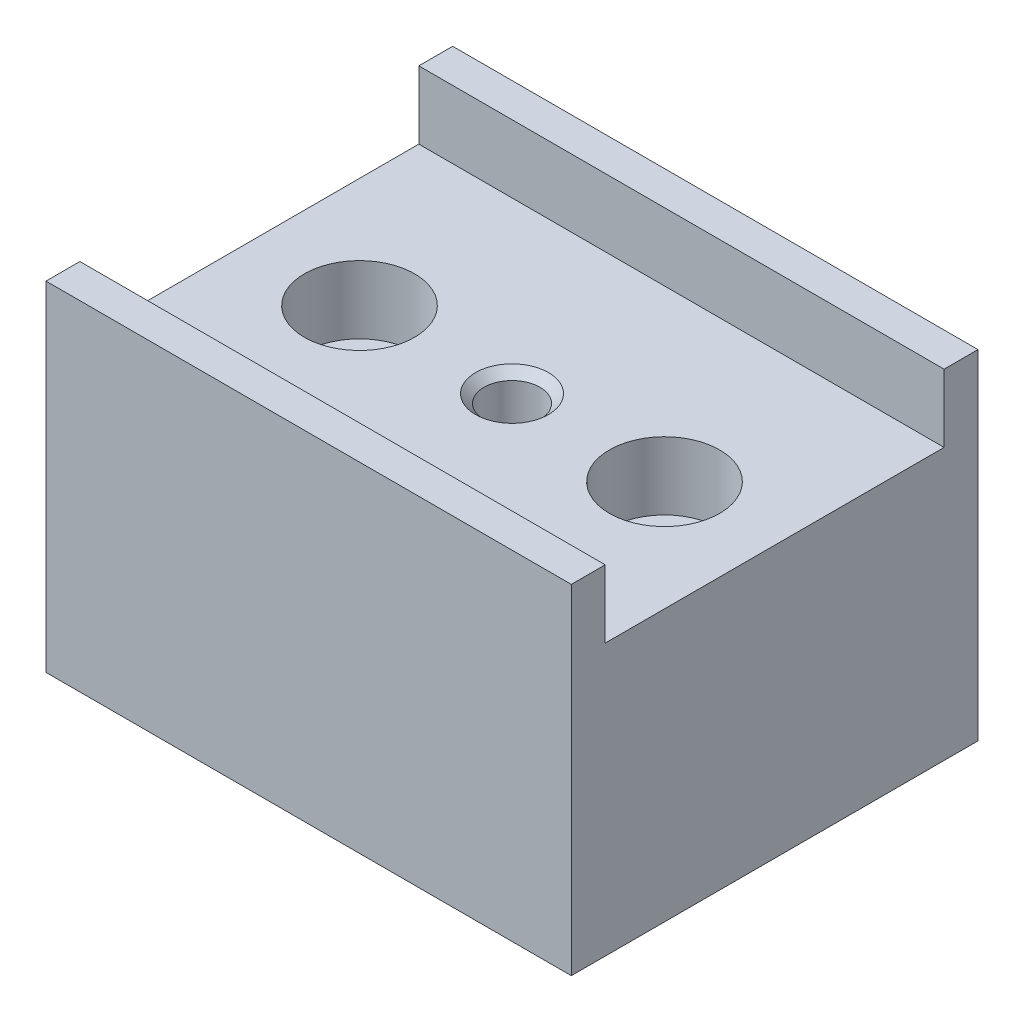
ISO-10303-21;
HEADER;
FILE_DESCRIPTION(('STEP AP214'),'2;1');
FILE_NAME('part.step','',(''),(''),'','','');
FILE_SCHEMA(('AUTOMOTIVE_DESIGN { 1 0 10303 214 1 1 1 1 }'));
ENDSEC;
DATA;
#1=APPLICATION_CONTEXT('core data for automotive mechanical design processes');
#2=APPLICATION_PROTOCOL_DEFINITION('international standard','automotive_design',2000,#1);
#3=PRODUCT_CONTEXT('',#1,'mechanical');
#4=PRODUCT('Part','Part','',(#3));
#5=PRODUCT_RELATED_PRODUCT_CATEGORY('part','',(#4));
#6=PRODUCT_DEFINITION_FORMATION('','',#4);
#7=PRODUCT_DEFINITION_CONTEXT('part definition',#1,'design');
#8=PRODUCT_DEFINITION('design','',#6,#7);
#9=PRODUCT_DEFINITION_SHAPE('','',#8);
#10=(LENGTH_UNIT() NAMED_UNIT(*) SI_UNIT(.MILLI.,.METRE.));
#11=(NAMED_UNIT(*) PLANE_ANGLE_UNIT() SI_UNIT($,.RADIAN.));
#12=(NAMED_UNIT(*) SI_UNIT($,.STERADIAN.) SOLID_ANGLE_UNIT());
#13=UNCERTAINTY_MEASURE_WITH_UNIT(LENGTH_MEASURE(1.E-05),#10,'distance_accuracy_value','');
#14=(GEOMETRIC_REPRESENTATION_CONTEXT(3) GLOBAL_UNCERTAINTY_ASSIGNED_CONTEXT((#13)) GLOBAL_UNIT_ASSIGNED_CONTEXT((#10,
#11,#12)) REPRESENTATION_CONTEXT('',''));
#15=CARTESIAN_POINT('',(0.,0.,0.));
#16=DIRECTION('',(0.,0.,1.));
#17=DIRECTION('',(1.,0.,0.));
#18=AXIS2_PLACEMENT_3D('',#15,#16,#17);
#19=CARTESIAN_POINT('',(-6.50000000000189,-1.16573417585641E-12,-3.77475828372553E-12));
#20=DIRECTION('',(0.,1.,0.));
#21=DIRECTION('',(0.,0.,1.));
#22=AXIS2_PLACEMENT_3D('',#19,#20,#21);
#23=CYLINDRICAL_SURFACE('',#22,1.7);
#24=CARTESIAN_POINT('',(-6.50000000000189,-1.16573417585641E-12,-3.77475828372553E-12));
#25=DIRECTION('',(0.,1.,0.));
#26=DIRECTION('',(0.,0.,1.));
#27=AXIS2_PLACEMENT_3D('',#24,#25,#26);
#28=CIRCLE('',#27,1.7);
#29=CARTESIAN_POINT('',(-6.50000000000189,-1.16582854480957E-12,1.69999999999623));
#30=VERTEX_POINT('',#29);
#31=EDGE_CURVE('E176',#30,#30,#28,.T.);
#32=CARTESIAN_POINT('',(-6.50000000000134,12.0000000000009,-3.99680288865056E-12));
#33=DIRECTION('',(0.,1.,0.));
#34=DIRECTION('',(0.,0.,1.));
#35=AXIS2_PLACEMENT_3D('',#32,#33,#34);
#36=CIRCLE('',#35,1.7);
#37=CARTESIAN_POINT('',(-6.50000000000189,12.0000000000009,1.69999999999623));
#38=VERTEX_POINT('',#37);
#39=EDGE_CURVE('E42',#38,#38,#36,.F.);
#40=CARTESIAN_POINT('',(-6.50000000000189,-1.16582854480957E-12,1.69999999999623));
#41=CARTESIAN_POINT('',(-6.50000000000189,0.124999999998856,1.69999999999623));
#42=CARTESIAN_POINT('',(-6.50000000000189,0.249999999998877,1.69999999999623));
#43=CARTESIAN_POINT('',(-6.50000000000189,0.49999999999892,1.69999999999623));
#44=CARTESIAN_POINT('',(-6.50000000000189,0.624999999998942,1.69999999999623));
#45=CARTESIAN_POINT('',(-6.50000000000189,0.874999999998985,1.69999999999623));
#46=CARTESIAN_POINT('',(-6.50000000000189,0.999999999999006,1.69999999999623));
#47=CARTESIAN_POINT('',(-6.50000000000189,1.24999999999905,1.69999999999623));
#48=CARTESIAN_POINT('',(-6.50000000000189,1.37499999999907,1.69999999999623));
#49=CARTESIAN_POINT('',(-6.50000000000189,1.62499999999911,1.69999999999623));
#50=CARTESIAN_POINT('',(-6.50000000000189,1.74999999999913,1.69999999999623));
#51=CARTESIAN_POINT('',(-6.50000000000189,1.99999999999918,1.69999999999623));
#52=CARTESIAN_POINT('',(-6.50000000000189,2.1249999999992,1.69999999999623));
#53=CARTESIAN_POINT('',(-6.50000000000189,2.37499999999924,1.69999999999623));
#54=CARTESIAN_POINT('',(-6.50000000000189,2.49999999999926,1.69999999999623));
#55=CARTESIAN_POINT('',(-6.50000000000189,2.74999999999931,1.69999999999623));
#56=CARTESIAN_POINT('',(-6.50000000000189,2.87499999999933,1.69999999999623));
#57=CARTESIAN_POINT('',(-6.50000000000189,3.12499999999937,1.69999999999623));
#58=CARTESIAN_POINT('',(-6.50000000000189,3.24999999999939,1.69999999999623));
#59=CARTESIAN_POINT('',(-6.50000000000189,3.49999999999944,1.69999999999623));
#60=CARTESIAN_POINT('',(-6.50000000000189,3.62499999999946,1.69999999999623));
#61=CARTESIAN_POINT('',(-6.50000000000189,3.8749999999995,1.69999999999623));
#62=CARTESIAN_POINT('',(-6.50000000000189,3.99999999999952,1.69999999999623));
#63=CARTESIAN_POINT('',(-6.50000000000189,4.24999999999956,1.69999999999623));
#64=CARTESIAN_POINT('',(-6.50000000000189,4.37499999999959,1.69999999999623));
#65=CARTESIAN_POINT('',(-6.50000000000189,4.62499999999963,1.69999999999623));
#66=CARTESIAN_POINT('',(-6.50000000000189,4.74999999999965,1.69999999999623));
#67=CARTESIAN_POINT('',(-6.50000000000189,4.99999999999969,1.69999999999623));
#68=CARTESIAN_POINT('',(-6.50000000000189,5.12499999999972,1.69999999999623));
#69=CARTESIAN_POINT('',(-6.50000000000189,5.37499999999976,1.69999999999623));
#70=CARTESIAN_POINT('',(-6.50000000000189,5.49999999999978,1.69999999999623));
#71=CARTESIAN_POINT('',(-6.50000000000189,5.74999999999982,1.69999999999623));
#72=CARTESIAN_POINT('',(-6.50000000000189,5.87499999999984,1.69999999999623));
#73=CARTESIAN_POINT('',(-6.50000000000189,6.12499999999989,1.69999999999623));
#74=CARTESIAN_POINT('',(-6.50000000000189,6.24999999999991,1.69999999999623));
#75=CARTESIAN_POINT('',(-6.50000000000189,6.49999999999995,1.69999999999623));
#76=CARTESIAN_POINT('',(-6.50000000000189,6.62499999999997,1.69999999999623));
#77=CARTESIAN_POINT('',(-6.50000000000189,6.87500000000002,1.69999999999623));
#78=CARTESIAN_POINT('',(-6.50000000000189,7.00000000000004,1.69999999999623));
#79=CARTESIAN_POINT('',(-6.50000000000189,7.25000000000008,1.69999999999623));
#80=CARTESIAN_POINT('',(-6.50000000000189,7.3750000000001,1.69999999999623));
#81=CARTESIAN_POINT('',(-6.50000000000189,7.62500000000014,1.69999999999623));
#82=CARTESIAN_POINT('',(-6.50000000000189,7.75000000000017,1.69999999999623));
#83=CARTESIAN_POINT('',(-6.50000000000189,8.00000000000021,1.69999999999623));
#84=CARTESIAN_POINT('',(-6.50000000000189,8.12500000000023,1.69999999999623));
#85=CARTESIAN_POINT('',(-6.50000000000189,8.37500000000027,1.69999999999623));
#86=CARTESIAN_POINT('',(-6.50000000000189,8.50000000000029,1.69999999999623));
#87=CARTESIAN_POINT('',(-6.50000000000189,8.75000000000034,1.69999999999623));
#88=CARTESIAN_POINT('',(-6.50000000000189,8.87500000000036,1.69999999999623));
#89=CARTESIAN_POINT('',(-6.50000000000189,9.1250000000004,1.69999999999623));
#90=CARTESIAN_POINT('',(-6.50000000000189,9.25000000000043,1.69999999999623));
#91=CARTESIAN_POINT('',(-6.50000000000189,9.50000000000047,1.69999999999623));
#92=CARTESIAN_POINT('',(-6.50000000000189,9.62500000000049,1.69999999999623));
#93=CARTESIAN_POINT('',(-6.50000000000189,9.87500000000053,1.69999999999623));
#94=CARTESIAN_POINT('',(-6.50000000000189,10.0000000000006,1.69999999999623));
#95=CARTESIAN_POINT('',(-6.50000000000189,10.2500000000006,1.69999999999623));
#96=CARTESIAN_POINT('',(-6.50000000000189,10.3750000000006,1.69999999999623));
#97=CARTESIAN_POINT('',(-6.50000000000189,10.6250000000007,1.69999999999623));
#98=CARTESIAN_POINT('',(-6.50000000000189,10.7500000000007,1.69999999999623));
#99=CARTESIAN_POINT('',(-6.50000000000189,11.0000000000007,1.69999999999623));
#100=CARTESIAN_POINT('',(-6.50000000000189,11.1250000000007,1.69999999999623));
#101=CARTESIAN_POINT('',(-6.50000000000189,11.3750000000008,1.69999999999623));
#102=CARTESIAN_POINT('',(-6.50000000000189,11.5000000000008,1.69999999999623));
#103=CARTESIAN_POINT('',(-6.50000000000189,11.7500000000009,1.69999999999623));
#104=CARTESIAN_POINT('',(-6.50000000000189,11.8750000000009,1.69999999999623));
#105=CARTESIAN_POINT('',(-6.50000000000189,12.0000000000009,1.69999999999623));
#106=B_SPLINE_CURVE_WITH_KNOTS('',3,(#40,#41,#42,#43,#44,#45,#46,#47,#48,#49,#50,#51,#52,#53,
#54,#55,#56,#57,#58,#59,#60,#61,#62,#63,#64,#65,#66,#67,#68,#69,#70,#71,#72,#73,#74,#75,#76,#77,
#78,#79,#80,#81,#82,#83,#84,#85,#86,#87,#88,#89,#90,#91,#92,#93,#94,#95,#96,#97,#98,#99,#100,
#101,#102,#103,#104,#105),.UNSPECIFIED.,.F.,.F.,(4,2,2,2,2,2,2,2,2,2,2,2,2,2,2,2,2,2,2,2,2,2,2,
2,2,2,2,2,2,2,2,2,4),(0.,0.375000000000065,0.750000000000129,1.12500000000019,1.50000000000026,
1.87500000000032,2.25000000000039,2.62500000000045,3.00000000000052,3.37500000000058,
3.75000000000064,4.12500000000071,4.50000000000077,4.87500000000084,5.2500000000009,
5.62500000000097,6.00000000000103,6.3750000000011,6.75000000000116,7.12500000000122,
7.50000000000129,7.87500000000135,8.25000000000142,8.62500000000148,9.00000000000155,
9.37500000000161,9.75000000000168,10.1250000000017,10.5000000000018,10.8750000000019,
11.2500000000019,11.625000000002,12.0000000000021),.UNSPECIFIED.);
#107=EDGE_CURVE('BSEAM38',#30,#38,#106,.T.);
#108=ORIENTED_EDGE('',*,*,#31,.F.);
#109=ORIENTED_EDGE('',*,*,#39,.F.);
#110=ORIENTED_EDGE('',*,*,#107,.T.);
#111=ORIENTED_EDGE('',*,*,#107,.F.);
#112=EDGE_LOOP('',(#108,#110,#109,#111));
#113=FACE_BOUND('',#112,.T.);
#114=ADVANCED_FACE('F38',(#113),#23,.F.);
#115=CARTESIAN_POINT('',(-24.5000000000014,2.22044604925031E-13,-2.88657986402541E-12));
#116=DIRECTION('',(0.,1.,0.));
#117=DIRECTION('',(0.,0.,1.));
#118=AXIS2_PLACEMENT_3D('',#115,#116,#117);
#119=CYLINDRICAL_SURFACE('',#118,1.7);
#120=CARTESIAN_POINT('',(-24.5000000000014,2.22044604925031E-13,-2.88657986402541E-12));
#121=DIRECTION('',(0.,1.,0.));
#122=DIRECTION('',(0.,0.,1.));
#123=AXIS2_PLACEMENT_3D('',#120,#121,#122);
#124=CIRCLE('',#123,1.7);
#125=CARTESIAN_POINT('',(-24.5000000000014,2.21950235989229E-13,1.69999999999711));
#126=VERTEX_POINT('',#125);
#127=EDGE_CURVE('E181',#126,#126,#124,.T.);
#128=CARTESIAN_POINT('',(-24.5000000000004,11.9999999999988,-3.99680288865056E-12));
#129=DIRECTION('',(0.,1.,0.));
#130=DIRECTION('',(0.,0.,1.));
#131=AXIS2_PLACEMENT_3D('',#128,#129,#130);
#132=CIRCLE('',#131,1.7);
#133=CARTESIAN_POINT('',(-24.5000000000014,11.9999999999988,1.69999999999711));
#134=VERTEX_POINT('',#133);
#135=EDGE_CURVE('E174',#134,#134,#132,.F.);
#136=CARTESIAN_POINT('',(-24.5000000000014,2.21950235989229E-13,1.69999999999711));
#137=CARTESIAN_POINT('',(-24.5000000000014,0.125000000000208,1.69999999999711));
#138=CARTESIAN_POINT('',(-24.5000000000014,0.250000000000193,1.69999999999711));
#139=CARTESIAN_POINT('',(-24.5000000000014,0.500000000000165,1.69999999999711));
#140=CARTESIAN_POINT('',(-24.5000000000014,0.62500000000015,1.69999999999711));
#141=CARTESIAN_POINT('',(-24.5000000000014,0.875000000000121,1.69999999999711));
#142=CARTESIAN_POINT('',(-24.5000000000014,1.00000000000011,1.69999999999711));
#143=CARTESIAN_POINT('',(-24.5000000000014,1.25000000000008,1.69999999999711));
#144=CARTESIAN_POINT('',(-24.5000000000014,1.37500000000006,1.69999999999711));
#145=CARTESIAN_POINT('',(-24.5000000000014,1.62500000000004,1.69999999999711));
#146=CARTESIAN_POINT('',(-24.5000000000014,1.75000000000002,1.69999999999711));
#147=CARTESIAN_POINT('',(-24.5000000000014,1.99999999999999,1.69999999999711));
#148=CARTESIAN_POINT('',(-24.5000000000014,2.12499999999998,1.69999999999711));
#149=CARTESIAN_POINT('',(-24.5000000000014,2.37499999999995,1.69999999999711));
#150=CARTESIAN_POINT('',(-24.5000000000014,2.49999999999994,1.69999999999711));
#151=CARTESIAN_POINT('',(-24.5000000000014,2.74999999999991,1.69999999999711));
#152=CARTESIAN_POINT('',(-24.5000000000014,2.87499999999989,1.69999999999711));
#153=CARTESIAN_POINT('',(-24.5000000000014,3.12499999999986,1.69999999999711));
#154=CARTESIAN_POINT('',(-24.5000000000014,3.24999999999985,1.69999999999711));
#155=CARTESIAN_POINT('',(-24.5000000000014,3.49999999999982,1.69999999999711));
#156=CARTESIAN_POINT('',(-24.5000000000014,3.62499999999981,1.69999999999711));
#157=CARTESIAN_POINT('',(-24.5000000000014,3.87499999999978,1.69999999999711));
#158=CARTESIAN_POINT('',(-24.5000000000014,3.99999999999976,1.69999999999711));
#159=CARTESIAN_POINT('',(-24.5000000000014,4.24999999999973,1.69999999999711));
#160=CARTESIAN_POINT('',(-24.5000000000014,4.37499999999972,1.69999999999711));
#161=CARTESIAN_POINT('',(-24.5000000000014,4.62499999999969,1.69999999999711));
#162=CARTESIAN_POINT('',(-24.5000000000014,4.74999999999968,1.69999999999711));
#163=CARTESIAN_POINT('',(-24.5000000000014,4.99999999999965,1.69999999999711));
#164=CARTESIAN_POINT('',(-24.5000000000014,5.12499999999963,1.69999999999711));
#165=CARTESIAN_POINT('',(-24.5000000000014,5.3749999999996,1.69999999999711));
#166=CARTESIAN_POINT('',(-24.5000000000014,5.49999999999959,1.69999999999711));
#167=CARTESIAN_POINT('',(-24.5000000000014,5.74999999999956,1.69999999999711));
#168=CARTESIAN_POINT('',(-24.5000000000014,5.87499999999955,1.69999999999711));
#169=CARTESIAN_POINT('',(-24.5000000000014,6.12499999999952,1.69999999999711));
#170=CARTESIAN_POINT('',(-24.5000000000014,6.2499999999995,1.69999999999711));
#171=CARTESIAN_POINT('',(-24.5000000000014,6.49999999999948,1.69999999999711));
#172=CARTESIAN_POINT('',(-24.5000000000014,6.62499999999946,1.69999999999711));
#173=CARTESIAN_POINT('',(-24.5000000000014,6.87499999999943,1.69999999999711));
#174=CARTESIAN_POINT('',(-24.5000000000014,6.99999999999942,1.69999999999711));
#175=CARTESIAN_POINT('',(-24.5000000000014,7.24999999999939,1.69999999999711));
#176=CARTESIAN_POINT('',(-24.5000000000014,7.37499999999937,1.69999999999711));
#177=CARTESIAN_POINT('',(-24.5000000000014,7.62499999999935,1.69999999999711));
#178=CARTESIAN_POINT('',(-24.5000000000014,7.74999999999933,1.69999999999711));
#179=CARTESIAN_POINT('',(-24.5000000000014,7.9999999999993,1.69999999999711));
#180=CARTESIAN_POINT('',(-24.5000000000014,8.12499999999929,1.69999999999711));
#181=CARTESIAN_POINT('',(-24.5000000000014,8.37499999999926,1.69999999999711));
#182=CARTESIAN_POINT('',(-24.5000000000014,8.49999999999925,1.69999999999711));
#183=CARTESIAN_POINT('',(-24.5000000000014,8.74999999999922,1.69999999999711));
#184=CARTESIAN_POINT('',(-24.5000000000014,8.8749999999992,1.69999999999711));
#185=CARTESIAN_POINT('',(-24.5000000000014,9.12499999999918,1.69999999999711));
#186=CARTESIAN_POINT('',(-24.5000000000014,9.24999999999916,1.69999999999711));
#187=CARTESIAN_POINT('',(-24.5000000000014,9.49999999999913,1.69999999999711));
#188=CARTESIAN_POINT('',(-24.5000000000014,9.62499999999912,1.69999999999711));
#189=CARTESIAN_POINT('',(-24.5000000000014,9.87499999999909,1.69999999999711));
#190=CARTESIAN_POINT('',(-24.5000000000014,9.99999999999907,1.69999999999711));
#191=CARTESIAN_POINT('',(-24.5000000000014,10.249999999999,1.69999999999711));
#192=CARTESIAN_POINT('',(-24.5000000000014,10.374999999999,1.69999999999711));
#193=CARTESIAN_POINT('',(-24.5000000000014,10.624999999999,1.69999999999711));
#194=CARTESIAN_POINT('',(-24.5000000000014,10.749999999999,1.69999999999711));
#195=CARTESIAN_POINT('',(-24.5000000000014,10.999999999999,1.69999999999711));
#196=CARTESIAN_POINT('',(-24.5000000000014,11.1249999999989,1.69999999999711));
#197=CARTESIAN_POINT('',(-24.5000000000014,11.3749999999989,1.69999999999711));
#198=CARTESIAN_POINT('',(-24.5000000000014,11.4999999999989,1.69999999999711));
#199=CARTESIAN_POINT('',(-24.5000000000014,11.7499999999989,1.69999999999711));
#200=CARTESIAN_POINT('',(-24.5000000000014,11.8749999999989,1.69999999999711));
#201=CARTESIAN_POINT('',(-24.5000000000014,11.9999999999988,1.69999999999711));
#202=B_SPLINE_CURVE_WITH_KNOTS('',3,(#136,#137,#138,#139,#140,#141,#142,#143,#144,#145,#146,
#147,#148,#149,#150,#151,#152,#153,#154,#155,#156,#157,#158,#159,#160,#161,#162,#163,#164,#165,
#166,#167,#168,#169,#170,#171,#172,#173,#174,#175,#176,#177,#178,#179,#180,#181,#182,#183,#184,
#185,#186,#187,#188,#189,#190,#191,#192,#193,#194,#195,#196,#197,#198,#199,#200,#201),
.UNSPECIFIED.,.F.,.F.,(4,2,2,2,2,2,2,2,2,2,2,2,2,2,2,2,2,2,2,2,2,2,2,2,2,2,2,2,2,2,2,2,4),(0.,
0.374999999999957,0.749999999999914,1.12499999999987,1.49999999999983,1.87499999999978,
2.24999999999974,2.6249999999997,2.99999999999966,3.37499999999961,3.74999999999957,
4.12499999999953,4.49999999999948,4.87499999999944,5.2499999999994,5.62499999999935,
5.99999999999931,6.37499999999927,6.74999999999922,7.12499999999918,7.49999999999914,
7.87499999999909,8.24999999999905,8.62499999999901,8.99999999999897,9.37499999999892,
9.74999999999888,10.1249999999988,10.4999999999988,10.8749999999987,11.2499999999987,
11.6249999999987,11.9999999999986),.UNSPECIFIED.);
#203=EDGE_CURVE('BSEAM225',#126,#134,#202,.T.);
#204=ORIENTED_EDGE('',*,*,#127,.F.);
#205=ORIENTED_EDGE('',*,*,#135,.F.);
#206=ORIENTED_EDGE('',*,*,#203,.T.);
#207=ORIENTED_EDGE('',*,*,#203,.F.);
#208=EDGE_LOOP('',(#204,#206,#205,#207));
#209=FACE_BOUND('',#208,.T.);
#210=ADVANCED_FACE('F225',(#209),#119,.F.);
#211=CARTESIAN_POINT('',(-31.0000000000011,20.0000000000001,-10.000000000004));
#212=DIRECTION('',(0.,0.,1.));
#213=DIRECTION('',(1.,0.,0.));
#214=AXIS2_PLACEMENT_3D('',#211,#212,#213);
#215=PLANE('',#214);
#216=DIRECTION('',(0.,-1.,0.));
#217=VECTOR('',#216,1.);
#218=CARTESIAN_POINT('',(-1.49880108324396E-12,19.9999999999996,-10.0000000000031));
#219=LINE('',#218,#217);
#220=CARTESIAN_POINT('',(-1.49880108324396E-12,19.9999999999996,-10.0000000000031));
#221=VERTEX_POINT('',#220);
#222=CARTESIAN_POINT('',(-2.1094237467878E-12,16.0000000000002,-10.0000000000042));
#223=VERTEX_POINT('',#222);
#224=EDGE_CURVE('E140',#221,#223,#219,.T.);
#225=ORIENTED_EDGE('',*,*,#224,.F.);
#226=DIRECTION('',(1.,0.,0.));
#227=VECTOR('',#226,1.);
#228=CARTESIAN_POINT('',(-31.0000000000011,20.0000000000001,-10.000000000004));
#229=LINE('',#228,#227);
#230=CARTESIAN_POINT('',(-31.0000000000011,20.0000000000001,-10.000000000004));
#231=VERTEX_POINT('',#230);
#232=EDGE_CURVE('E57',#231,#221,#229,.T.);
#233=ORIENTED_EDGE('',*,*,#232,.F.);
#234=DIRECTION('',(0.,-1.,0.));
#235=VECTOR('',#234,1.);
#236=CARTESIAN_POINT('',(-31.0000000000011,20.0000000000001,-10.000000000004));
#237=LINE('',#236,#235);
#238=CARTESIAN_POINT('',(-31.0000000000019,15.9999999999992,-10.0000000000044));
#239=VERTEX_POINT('',#238);
#240=EDGE_CURVE('E162',#231,#239,#237,.T.);
#241=ORIENTED_EDGE('',*,*,#240,.T.);
#242=DIRECTION('',(1.,0.,0.));
#243=VECTOR('',#242,1.);
#244=CARTESIAN_POINT('',(-31.0000000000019,15.9999999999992,-10.0000000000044));
#245=LINE('',#244,#243);
#246=EDGE_CURVE('E98',#239,#223,#245,.T.);
#247=ORIENTED_EDGE('',*,*,#246,.T.);
#248=EDGE_LOOP('',(#225,#233,#241,#247));
#249=FACE_BOUND('',#248,.T.);
#250=ADVANCED_FACE('F214',(#249),#215,.T.);
#251=CARTESIAN_POINT('',(-31.0000000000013,19.9999999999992,-12.000000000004));
#252=DIRECTION('',(0.,1.,0.));
#253=DIRECTION('',(0.,0.,1.));
#254=AXIS2_PLACEMENT_3D('',#251,#252,#253);
#255=PLANE('',#254);
#256=DIRECTION('',(0.,0.,1.));
#257=VECTOR('',#256,1.);
#258=CARTESIAN_POINT('',(-1.0547118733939E-12,19.9999999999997,-12.0000000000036));
#259=LINE('',#258,#257);
#260=CARTESIAN_POINT('',(-1.0547118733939E-12,19.9999999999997,-12.0000000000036));
#261=VERTEX_POINT('',#260);
#262=EDGE_CURVE('E159',#261,#221,#259,.T.);
#263=ORIENTED_EDGE('',*,*,#262,.F.);
#264=DIRECTION('',(1.,0.,0.));
#265=VECTOR('',#264,1.);
#266=CARTESIAN_POINT('',(-31.0000000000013,19.9999999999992,-12.000000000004));
#267=LINE('',#266,#265);
#268=CARTESIAN_POINT('',(-31.0000000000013,19.9999999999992,-12.000000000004));
#269=VERTEX_POINT('',#268);
#270=EDGE_CURVE('E86',#269,#261,#267,.T.);
#271=ORIENTED_EDGE('',*,*,#270,.F.);
#272=DIRECTION('',(0.,0.,1.));
#273=VECTOR('',#272,1.);
#274=CARTESIAN_POINT('',(-31.0000000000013,19.9999999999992,-12.000000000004));
#275=LINE('',#274,#273);
#276=EDGE_CURVE('E130',#269,#231,#275,.T.);
#277=ORIENTED_EDGE('',*,*,#276,.T.);
#278=ORIENTED_EDGE('',*,*,#232,.T.);
#279=EDGE_LOOP('',(#263,#271,#277,#278));
#280=FACE_BOUND('',#279,.T.);
#281=ADVANCED_FACE('F217',(#280),#255,.T.);
#282=CARTESIAN_POINT('',(-31.0000000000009,-7.7715611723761E-13,-12.0000000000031));
#283=DIRECTION('',(0.,0.,-1.));
#284=DIRECTION('',(-1.,0.,0.));
#285=AXIS2_PLACEMENT_3D('',#282,#283,#284);
#286=PLANE('',#285);
#287=DIRECTION('',(0.,1.,0.));
#288=VECTOR('',#287,1.);
#289=CARTESIAN_POINT('',(-7.7715611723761E-13,4.9960036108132E-13,-12.0000000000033));
#290=LINE('',#289,#288);
#291=CARTESIAN_POINT('',(-7.7715611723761E-13,4.9960036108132E-13,-12.0000000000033));
#292=VERTEX_POINT('',#291);
#293=EDGE_CURVE('E117',#292,#261,#290,.T.);
#294=ORIENTED_EDGE('',*,*,#293,.F.);
#295=DIRECTION('',(1.,0.,0.));
#296=VECTOR('',#295,1.);
#297=CARTESIAN_POINT('',(-31.0000000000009,-7.7715611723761E-13,-12.0000000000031));
#298=LINE('',#297,#296);
#299=CARTESIAN_POINT('',(-31.0000000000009,-7.7715611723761E-13,-12.0000000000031));
#300=VERTEX_POINT('',#299);
#301=EDGE_CURVE('E112',#300,#292,#298,.T.);
#302=ORIENTED_EDGE('',*,*,#301,.F.);
#303=DIRECTION('',(0.,1.,0.));
#304=VECTOR('',#303,1.);
#305=CARTESIAN_POINT('',(-31.0000000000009,-7.7715611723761E-13,-12.0000000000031));
#306=LINE('',#305,#304);
#307=EDGE_CURVE('E115',#300,#269,#306,.T.);
#308=ORIENTED_EDGE('',*,*,#307,.T.);
#309=ORIENTED_EDGE('',*,*,#270,.T.);
#310=EDGE_LOOP('',(#294,#302,#308,#309));
#311=FACE_BOUND('',#310,.T.);
#312=ADVANCED_FACE('F114',(#311),#286,.T.);
#313=CARTESIAN_POINT('',(-31.0000000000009,-7.7715611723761E-13,-12.0000000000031));
#314=DIRECTION('',(0.,-1.,0.));
#315=DIRECTION('',(0.,0.,-1.));
#316=AXIS2_PLACEMENT_3D('',#313,#314,#315);
#317=PLANE('',#316);
#318=ORIENTED_EDGE('',*,*,#31,.T.);
#319=EDGE_LOOP('',(#318));
#320=FACE_BOUND('',#319,.T.);
#321=ORIENTED_EDGE('',*,*,#127,.T.);
#322=EDGE_LOOP('',(#321));
#323=FACE_BOUND('',#322,.T.);
#324=CARTESIAN_POINT('',(-15.5,-9.99200722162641E-13,-3.77475828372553E-12));
#325=DIRECTION('',(0.,1.,0.));
#326=DIRECTION('',(0.,0.,1.));
#327=AXIS2_PLACEMENT_3D('',#324,#325,#326);
#328=CIRCLE('',#327,1.65);
#329=CARTESIAN_POINT('',(-15.5000000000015,-9.99200722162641E-13,1.64999999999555));
#330=VERTEX_POINT('',#329);
#331=EDGE_CURVE('E144',#330,#330,#328,.T.);
#332=ORIENTED_EDGE('',*,*,#331,.T.);
#333=EDGE_LOOP('',(#332));
#334=FACE_BOUND('',#333,.T.);
#335=DIRECTION('',(0.,0.,-1.));
#336=VECTOR('',#335,1.);
#337=CARTESIAN_POINT('',(-7.7715611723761E-13,4.9960036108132E-13,-12.0000000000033));
#338=LINE('',#337,#336);
#339=CARTESIAN_POINT('',(-1.66533453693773E-12,-7.21644966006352E-13,11.9999999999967));
#340=VERTEX_POINT('',#339);
#341=EDGE_CURVE('E156',#340,#292,#338,.T.);
#342=ORIENTED_EDGE('',*,*,#341,.F.);
#343=DIRECTION('',(1.,0.,0.));
#344=VECTOR('',#343,1.);
#345=CARTESIAN_POINT('',(-31.0000000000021,8.88178419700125E-13,11.9999999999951));
#346=LINE('',#345,#344);
#347=CARTESIAN_POINT('',(-31.0000000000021,8.88178419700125E-13,11.9999999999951));
#348=VERTEX_POINT('',#347);
#349=EDGE_CURVE('E122',#348,#340,#346,.T.);
#350=ORIENTED_EDGE('',*,*,#349,.F.);
#351=DIRECTION('',(0.,0.,-1.));
#352=VECTOR('',#351,1.);
#353=CARTESIAN_POINT('',(-31.0000000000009,-7.7715611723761E-13,-12.0000000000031));
#354=LINE('',#353,#352);
#355=EDGE_CURVE('E128',#348,#300,#354,.T.);
#356=ORIENTED_EDGE('',*,*,#355,.T.);
#357=ORIENTED_EDGE('',*,*,#301,.T.);
#358=EDGE_LOOP('',(#342,#350,#356,#357));
#359=FACE_BOUND('',#358,.T.);
#360=ADVANCED_FACE('F132',(#320,#323,#334,#359),#317,.T.);
#361=CARTESIAN_POINT('',(-31.0000000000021,8.88178419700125E-13,11.9999999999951));
#362=DIRECTION('',(0.,0.,1.));
#363=DIRECTION('',(1.,0.,0.));
#364=AXIS2_PLACEMENT_3D('',#361,#362,#363);
#365=PLANE('',#364);
#366=DIRECTION('',(0.,-1.,0.));
#367=VECTOR('',#366,1.);
#368=CARTESIAN_POINT('',(-1.66533453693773E-12,-7.21644966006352E-13,11.9999999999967));
#369=LINE('',#368,#367);
#370=CARTESIAN_POINT('',(-7.7715611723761E-13,19.9999999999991,11.9999999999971));
#371=VERTEX_POINT('',#370);
#372=EDGE_CURVE('E153',#371,#340,#369,.T.);
#373=ORIENTED_EDGE('',*,*,#372,.F.);
#374=DIRECTION('',(1.,0.,0.));
#375=VECTOR('',#374,1.);
#376=CARTESIAN_POINT('',(-31.0000000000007,20.0000000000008,11.9999999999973));
#377=LINE('',#376,#375);
#378=CARTESIAN_POINT('',(-31.0000000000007,20.0000000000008,11.9999999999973));
#379=VERTEX_POINT('',#378);
#380=EDGE_CURVE('E166',#379,#371,#377,.T.);
#381=ORIENTED_EDGE('',*,*,#380,.F.);
#382=DIRECTION('',(0.,-1.,0.));
#383=VECTOR('',#382,1.);
#384=CARTESIAN_POINT('',(-31.0000000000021,8.88178419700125E-13,11.9999999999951));
#385=LINE('',#384,#383);
#386=EDGE_CURVE('E133',#379,#348,#385,.T.);
#387=ORIENTED_EDGE('',*,*,#386,.T.);
#388=ORIENTED_EDGE('',*,*,#349,.T.);
#389=EDGE_LOOP('',(#373,#381,#387,#388));
#390=FACE_BOUND('',#389,.T.);
#391=ADVANCED_FACE('F314',(#390),#365,.T.);
#392=CARTESIAN_POINT('',(-31.0000000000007,20.0000000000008,11.9999999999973));
#393=DIRECTION('',(0.,1.,0.));
#394=DIRECTION('',(0.,0.,1.));
#395=AXIS2_PLACEMENT_3D('',#392,#393,#394);
#396=PLANE('',#395);
#397=DIRECTION('',(0.,0.,1.));
#398=VECTOR('',#397,1.);
#399=CARTESIAN_POINT('',(-7.7715611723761E-13,19.9999999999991,11.9999999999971));
#400=LINE('',#399,#398);
#401=CARTESIAN_POINT('',(-1.16573417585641E-12,20.0000000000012,9.99999999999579));
#402=VERTEX_POINT('',#401);
#403=EDGE_CURVE('E150',#402,#371,#400,.T.);
#404=ORIENTED_EDGE('',*,*,#403,.F.);
#405=DIRECTION('',(1.,0.,0.));
#406=VECTOR('',#405,1.);
#407=CARTESIAN_POINT('',(-31.0000000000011,19.9999999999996,9.99999999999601));
#408=LINE('',#407,#406);
#409=CARTESIAN_POINT('',(-31.0000000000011,19.9999999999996,9.99999999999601));
#410=VERTEX_POINT('',#409);
#411=EDGE_CURVE('E168',#410,#402,#408,.T.);
#412=ORIENTED_EDGE('',*,*,#411,.F.);
#413=DIRECTION('',(0.,0.,1.));
#414=VECTOR('',#413,1.);
#415=CARTESIAN_POINT('',(-31.0000000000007,20.0000000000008,11.9999999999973));
#416=LINE('',#415,#414);
#417=EDGE_CURVE('E135',#410,#379,#416,.T.);
#418=ORIENTED_EDGE('',*,*,#417,.T.);
#419=ORIENTED_EDGE('',*,*,#380,.T.);
#420=EDGE_LOOP('',(#404,#412,#418,#419));
#421=FACE_BOUND('',#420,.T.);
#422=ADVANCED_FACE('F207',(#421),#396,.T.);
#423=CARTESIAN_POINT('',(-31.0000000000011,19.9999999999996,9.99999999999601));
#424=DIRECTION('',(0.,0.,-1.));
#425=DIRECTION('',(-1.,0.,0.));
#426=AXIS2_PLACEMENT_3D('',#423,#424,#425);
#427=PLANE('',#426);
#428=DIRECTION('',(0.,1.,0.));
#429=VECTOR('',#428,1.);
#430=CARTESIAN_POINT('',(-1.16573417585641E-12,20.0000000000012,9.99999999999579));
#431=LINE('',#430,#429);
#432=CARTESIAN_POINT('',(-1.33226762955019E-12,16.0000000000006,9.99999999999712));
#433=VERTEX_POINT('',#432);
#434=EDGE_CURVE('E147',#433,#402,#431,.T.);
#435=ORIENTED_EDGE('',*,*,#434,.F.);
#436=DIRECTION('',(1.,0.,0.));
#437=VECTOR('',#436,1.);
#438=CARTESIAN_POINT('',(-31.0000000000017,15.9999999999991,9.99999999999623));
#439=LINE('',#438,#437);
#440=CARTESIAN_POINT('',(-31.0000000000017,15.9999999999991,9.99999999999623));
#441=VERTEX_POINT('',#440);
#442=EDGE_CURVE('E170',#441,#433,#439,.T.);
#443=ORIENTED_EDGE('',*,*,#442,.F.);
#444=DIRECTION('',(0.,1.,0.));
#445=VECTOR('',#444,1.);
#446=CARTESIAN_POINT('',(-31.0000000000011,19.9999999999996,9.99999999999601));
#447=LINE('',#446,#445);
#448=EDGE_CURVE('E201',#441,#410,#447,.T.);
#449=ORIENTED_EDGE('',*,*,#448,.T.);
#450=ORIENTED_EDGE('',*,*,#411,.T.);
#451=EDGE_LOOP('',(#435,#443,#449,#450));
#452=FACE_BOUND('',#451,.T.);
#453=ADVANCED_FACE('F212',(#452),#427,.T.);
#454=CARTESIAN_POINT('',(-31.0000000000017,15.9999999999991,9.99999999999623));
#455=DIRECTION('',(0.,1.,0.));
#456=DIRECTION('',(0.,0.,1.));
#457=AXIS2_PLACEMENT_3D('',#454,#455,#456);
#458=PLANE('',#457);
#459=CARTESIAN_POINT('',(-6.50000000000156,16.0000000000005,-3.77475828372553E-12));
#460=DIRECTION('',(0.,1.,0.));
#461=DIRECTION('',(0.,0.,1.));
#462=AXIS2_PLACEMENT_3D('',#459,#460,#461);
#463=CIRCLE('',#462,3.25);
#464=CARTESIAN_POINT('',(-6.50000000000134,16.0000000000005,3.249999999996));
#465=VERTEX_POINT('',#464);
#466=EDGE_CURVE('E191',#465,#465,#463,.T.);
#467=ORIENTED_EDGE('',*,*,#466,.F.);
#468=EDGE_LOOP('',(#467));
#469=FACE_BOUND('',#468,.T.);
#470=CARTESIAN_POINT('',(-24.5000000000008,15.9999999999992,-2.66453525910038E-12));
#471=DIRECTION('',(0.,1.,0.));
#472=DIRECTION('',(0.,0.,1.));
#473=AXIS2_PLACEMENT_3D('',#470,#471,#472);
#474=CIRCLE('',#473,3.25);
#475=CARTESIAN_POINT('',(-24.5000000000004,15.9999999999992,3.249999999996));
#476=VERTEX_POINT('',#475);
#477=EDGE_CURVE('E184',#476,#476,#474,.T.);
#478=ORIENTED_EDGE('',*,*,#477,.F.);
#479=EDGE_LOOP('',(#478));
#480=FACE_BOUND('',#479,.T.);
#481=CARTESIAN_POINT('',(-15.5000000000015,15.9999999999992,-4.44089209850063E-12));
#482=DIRECTION('',(0.,1.,0.));
#483=DIRECTION('',(0.,0.,1.));
#484=AXIS2_PLACEMENT_3D('',#481,#482,#483);
#485=CIRCLE('',#484,2.14999999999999);
#486=CARTESIAN_POINT('',(-15.5000000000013,15.9999999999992,2.14999999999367));
#487=VERTEX_POINT('',#486);
#488=EDGE_CURVE('E11',#487,#487,#485,.F.);
#489=ORIENTED_EDGE('',*,*,#488,.T.);
#490=EDGE_LOOP('',(#489));
#491=FACE_BOUND('',#490,.T.);
#492=DIRECTION('',(0.,0.,1.));
#493=VECTOR('',#492,1.);
#494=CARTESIAN_POINT('',(-1.33226762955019E-12,16.0000000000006,9.99999999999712));
#495=LINE('',#494,#493);
#496=EDGE_CURVE('E143',#223,#433,#495,.T.);
#497=ORIENTED_EDGE('',*,*,#496,.F.);
#498=ORIENTED_EDGE('',*,*,#246,.F.);
#499=DIRECTION('',(0.,0.,1.));
#500=VECTOR('',#499,1.);
#501=CARTESIAN_POINT('',(-31.0000000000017,15.9999999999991,9.99999999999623));
#502=LINE('',#501,#500);
#503=EDGE_CURVE('E199',#239,#441,#502,.T.);
#504=ORIENTED_EDGE('',*,*,#503,.T.);
#505=ORIENTED_EDGE('',*,*,#442,.T.);
#506=EDGE_LOOP('',(#497,#498,#504,#505));
#507=FACE_BOUND('',#506,.T.);
#508=ADVANCED_FACE('F213',(#469,#480,#491,#507),#458,.T.);
#509=CARTESIAN_POINT('',(-31.0000000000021,-1.4432899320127E-12,-2.44249065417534E-12));
#510=DIRECTION('',(1.,0.,0.));
#511=DIRECTION('',(0.,0.,-1.));
#512=AXIS2_PLACEMENT_3D('',#509,#510,#511);
#513=PLANE('',#512);
#514=ORIENTED_EDGE('',*,*,#240,.F.);
#515=ORIENTED_EDGE('',*,*,#276,.F.);
#516=ORIENTED_EDGE('',*,*,#307,.F.);
#517=ORIENTED_EDGE('',*,*,#355,.F.);
#518=ORIENTED_EDGE('',*,*,#386,.F.);
#519=ORIENTED_EDGE('',*,*,#417,.F.);
#520=ORIENTED_EDGE('',*,*,#448,.F.);
#521=ORIENTED_EDGE('',*,*,#503,.F.);
#522=EDGE_LOOP('',(#514,#515,#516,#517,#518,#519,#520,#521));
#523=FACE_BOUND('',#522,.T.);
#524=ADVANCED_FACE('F126',(#523),#513,.F.);
#525=CARTESIAN_POINT('',(0.,0.,0.));
#526=DIRECTION('',(1.,0.,0.));
#527=DIRECTION('',(0.,0.,-1.));
#528=AXIS2_PLACEMENT_3D('',#525,#526,#527);
#529=PLANE('',#528);
#530=ORIENTED_EDGE('',*,*,#224,.T.);
#531=ORIENTED_EDGE('',*,*,#496,.T.);
#532=ORIENTED_EDGE('',*,*,#434,.T.);
#533=ORIENTED_EDGE('',*,*,#403,.T.);
#534=ORIENTED_EDGE('',*,*,#372,.T.);
#535=ORIENTED_EDGE('',*,*,#341,.T.);
#536=ORIENTED_EDGE('',*,*,#293,.T.);
#537=ORIENTED_EDGE('',*,*,#262,.T.);
#538=EDGE_LOOP('',(#530,#531,#532,#533,#534,#535,#536,#537));
#539=FACE_BOUND('',#538,.T.);
#540=ADVANCED_FACE('F216',(#539),#529,.T.);
#541=CARTESIAN_POINT('',(-15.5000000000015,15.9999999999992,-4.44089209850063E-12));
#542=DIRECTION('',(0.,1.,0.));
#543=DIRECTION('',(0.,0.,1.));
#544=AXIS2_PLACEMENT_3D('',#541,#542,#543);
#545=CYLINDRICAL_SURFACE('',#544,1.64999999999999);
#546=CARTESIAN_POINT('',(-15.5000000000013,15.5,-5.55111512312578E-12));
#547=DIRECTION('',(0.,1.,0.));
#548=DIRECTION('',(0.,0.,1.));
#549=AXIS2_PLACEMENT_3D('',#546,#547,#548);
#550=CIRCLE('',#549,1.64999999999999);
#551=CARTESIAN_POINT('',(-15.5000000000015,15.5,1.64999999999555));
#552=VERTEX_POINT('',#551);
#553=EDGE_CURVE('E48',#552,#552,#550,.T.);
#554=CARTESIAN_POINT('',(-15.5000000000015,15.5,1.64999999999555));
#555=CARTESIAN_POINT('',(-15.5000000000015,15.3385416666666,1.64999999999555));
#556=CARTESIAN_POINT('',(-15.5000000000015,15.1770833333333,1.64999999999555));
#557=CARTESIAN_POINT('',(-15.5000000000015,14.8541666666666,1.64999999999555));
#558=CARTESIAN_POINT('',(-15.5000000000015,14.6927083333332,1.64999999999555));
#559=CARTESIAN_POINT('',(-15.5000000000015,14.3697916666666,1.64999999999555));
#560=CARTESIAN_POINT('',(-15.5000000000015,14.2083333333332,1.64999999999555));
#561=CARTESIAN_POINT('',(-15.5000000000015,13.8854166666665,1.64999999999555));
#562=CARTESIAN_POINT('',(-15.5000000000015,13.7239583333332,1.64999999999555));
#563=CARTESIAN_POINT('',(-15.5000000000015,13.4010416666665,1.64999999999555));
#564=CARTESIAN_POINT('',(-15.5000000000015,13.2395833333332,1.64999999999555));
#565=CARTESIAN_POINT('',(-15.5000000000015,12.9166666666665,1.64999999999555));
#566=CARTESIAN_POINT('',(-15.5000000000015,12.7552083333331,1.64999999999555));
#567=CARTESIAN_POINT('',(-15.5000000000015,12.4322916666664,1.64999999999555));
#568=CARTESIAN_POINT('',(-15.5000000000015,12.2708333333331,1.64999999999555));
#569=CARTESIAN_POINT('',(-15.5000000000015,11.9479166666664,1.64999999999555));
#570=CARTESIAN_POINT('',(-15.5000000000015,11.7864583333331,1.64999999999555));
#571=CARTESIAN_POINT('',(-15.5000000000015,11.4635416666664,1.64999999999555));
#572=CARTESIAN_POINT('',(-15.5000000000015,11.302083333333,1.64999999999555));
#573=CARTESIAN_POINT('',(-15.5000000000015,10.9791666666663,1.64999999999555));
#574=CARTESIAN_POINT('',(-15.5000000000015,10.817708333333,1.64999999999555));
#575=CARTESIAN_POINT('',(-15.5000000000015,10.4947916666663,1.64999999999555));
#576=CARTESIAN_POINT('',(-15.5000000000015,10.333333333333,1.64999999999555));
#577=CARTESIAN_POINT('',(-15.5000000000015,10.0104166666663,1.64999999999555));
#578=CARTESIAN_POINT('',(-15.5000000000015,9.84895833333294,1.64999999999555));
#579=CARTESIAN_POINT('',(-15.5000000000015,9.52604166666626,1.64999999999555));
#580=CARTESIAN_POINT('',(-15.5000000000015,9.36458333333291,1.64999999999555));
#581=CARTESIAN_POINT('',(-15.5000000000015,9.04166666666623,1.64999999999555));
#582=CARTESIAN_POINT('',(-15.5000000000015,8.88020833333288,1.64999999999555));
#583=CARTESIAN_POINT('',(-15.5000000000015,8.5572916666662,1.64999999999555));
#584=CARTESIAN_POINT('',(-15.5000000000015,8.39583333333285,1.64999999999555));
#585=CARTESIAN_POINT('',(-15.5000000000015,8.07291666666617,1.64999999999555));
#586=CARTESIAN_POINT('',(-15.5000000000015,7.91145833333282,1.64999999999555));
#587=CARTESIAN_POINT('',(-15.5000000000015,7.58854166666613,1.64999999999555));
#588=CARTESIAN_POINT('',(-15.5000000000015,7.42708333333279,1.64999999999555));
#589=CARTESIAN_POINT('',(-15.5000000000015,7.1041666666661,1.64999999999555));
#590=CARTESIAN_POINT('',(-15.5000000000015,6.94270833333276,1.64999999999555));
#591=CARTESIAN_POINT('',(-15.5000000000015,6.61979166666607,1.64999999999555));
#592=CARTESIAN_POINT('',(-15.5000000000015,6.45833333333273,1.64999999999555));
#593=CARTESIAN_POINT('',(-15.5000000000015,6.13541666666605,1.64999999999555));
#594=CARTESIAN_POINT('',(-15.5000000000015,5.9739583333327,1.64999999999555));
#595=CARTESIAN_POINT('',(-15.5000000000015,5.65104166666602,1.64999999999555));
#596=CARTESIAN_POINT('',(-15.5000000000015,5.48958333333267,1.64999999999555));
#597=CARTESIAN_POINT('',(-15.5000000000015,5.16666666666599,1.64999999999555));
#598=CARTESIAN_POINT('',(-15.5000000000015,5.00520833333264,1.64999999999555));
#599=CARTESIAN_POINT('',(-15.5000000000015,4.68229166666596,1.64999999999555));
#600=CARTESIAN_POINT('',(-15.5000000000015,4.52083333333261,1.64999999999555));
#601=CARTESIAN_POINT('',(-15.5000000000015,4.19791666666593,1.64999999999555));
#602=CARTESIAN_POINT('',(-15.5000000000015,4.03645833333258,1.64999999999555));
#603=CARTESIAN_POINT('',(-15.5000000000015,3.7135416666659,1.64999999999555));
#604=CARTESIAN_POINT('',(-15.5000000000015,3.55208333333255,1.64999999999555));
#605=CARTESIAN_POINT('',(-15.5000000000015,3.22916666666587,1.64999999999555));
#606=CARTESIAN_POINT('',(-15.5000000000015,3.06770833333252,1.64999999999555));
#607=CARTESIAN_POINT('',(-15.5000000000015,2.74479166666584,1.64999999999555));
#608=CARTESIAN_POINT('',(-15.5000000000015,2.58333333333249,1.64999999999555));
#609=CARTESIAN_POINT('',(-15.5000000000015,2.26041666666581,1.64999999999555));
#610=CARTESIAN_POINT('',(-15.5000000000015,2.09895833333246,1.64999999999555));
#611=CARTESIAN_POINT('',(-15.5000000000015,1.77604166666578,1.64999999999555));
#612=CARTESIAN_POINT('',(-15.5000000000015,1.61458333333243,1.64999999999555));
#613=CARTESIAN_POINT('',(-15.5000000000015,1.29166666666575,1.64999999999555));
#614=CARTESIAN_POINT('',(-15.5000000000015,1.1302083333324,1.64999999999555));
#615=CARTESIAN_POINT('',(-15.5000000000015,0.807291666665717,1.64999999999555));
#616=CARTESIAN_POINT('',(-15.5000000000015,0.645833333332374,1.64999999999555));
#617=CARTESIAN_POINT('',(-15.5000000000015,0.322916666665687,1.64999999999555));
#618=CARTESIAN_POINT('',(-15.5000000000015,0.161458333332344,1.64999999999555));
#619=CARTESIAN_POINT('',(-15.5000000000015,-9.99200722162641E-13,1.64999999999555));
#620=B_SPLINE_CURVE_WITH_KNOTS('',3,(#554,#555,#556,#557,#558,#559,#560,#561,#562,#563,#564,
#565,#566,#567,#568,#569,#570,#571,#572,#573,#574,#575,#576,#577,#578,#579,#580,#581,#582,#583,
#584,#585,#586,#587,#588,#589,#590,#591,#592,#593,#594,#595,#596,#597,#598,#599,#600,#601,#602,
#603,#604,#605,#606,#607,#608,#609,#610,#611,#612,#613,#614,#615,#616,#617,#618,#619),
.UNSPECIFIED.,.F.,.F.,(4,2,2,2,2,2,2,2,2,2,2,2,2,2,2,2,2,2,2,2,2,2,2,2,2,2,2,2,2,2,2,2,4),(0.,
0.48437500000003,0.96875000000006,1.45312500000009,1.93750000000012,2.42187500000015,
2.90625000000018,3.39062500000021,3.87500000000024,4.35937500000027,4.8437500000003,
5.32812500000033,5.81250000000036,6.29687500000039,6.78125000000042,7.26562500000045,
7.75000000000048,8.23437500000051,8.71875000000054,9.20312500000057,9.6875000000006,
10.1718750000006,10.6562500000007,11.1406250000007,11.6250000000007,12.1093750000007,
12.5937500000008,13.0781250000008,13.5625000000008,14.0468750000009,14.5312500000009,
15.0156250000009,15.500000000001),.UNSPECIFIED.);
#621=EDGE_CURVE('BSEAM241',#552,#330,#620,.T.);
#622=ORIENTED_EDGE('',*,*,#553,.T.);
#623=ORIENTED_EDGE('',*,*,#331,.F.);
#624=ORIENTED_EDGE('',*,*,#621,.T.);
#625=ORIENTED_EDGE('',*,*,#621,.F.);
#626=EDGE_LOOP('',(#622,#624,#623,#625));
#627=FACE_BOUND('',#626,.T.);
#628=ADVANCED_FACE('F241',(#627),#545,.F.);
#629=CARTESIAN_POINT('',(-15.5000000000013,15.5,-5.55111512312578E-12));
#630=DIRECTION('',(0.,1.,0.));
#631=DIRECTION('',(0.,0.,1.));
#632=AXIS2_PLACEMENT_3D('',#629,#630,#631);
#633=CONICAL_SURFACE('',#632,1.64999999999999,0.785398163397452);
#634=CARTESIAN_POINT('',(-15.5000000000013,15.9999999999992,2.14999999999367));
#635=CARTESIAN_POINT('',(-15.5000000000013,15.9947916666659,2.14479166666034));
#636=CARTESIAN_POINT('',(-15.5000000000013,15.9895833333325,2.13958333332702));
#637=CARTESIAN_POINT('',(-15.5000000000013,15.9791666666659,2.12916666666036));
#638=CARTESIAN_POINT('',(-15.5000000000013,15.9739583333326,2.12395833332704));
#639=CARTESIAN_POINT('',(-15.5000000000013,15.9635416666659,2.11354166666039));
#640=CARTESIAN_POINT('',(-15.5000000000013,15.9583333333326,2.10833333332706));
#641=CARTESIAN_POINT('',(-15.5000000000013,15.9479166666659,2.09791666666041));
#642=CARTESIAN_POINT('',(-15.5000000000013,15.9427083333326,2.09270833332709));
#643=CARTESIAN_POINT('',(-15.5000000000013,15.932291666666,2.08229166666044));
#644=CARTESIAN_POINT('',(-15.5000000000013,15.9270833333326,2.07708333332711));
#645=CARTESIAN_POINT('',(-15.5000000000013,15.916666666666,2.06666666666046));
#646=CARTESIAN_POINT('',(-15.5000000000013,15.9114583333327,2.06145833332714));
#647=CARTESIAN_POINT('',(-15.5000000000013,15.901041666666,2.05104166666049));
#648=CARTESIAN_POINT('',(-15.5000000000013,15.8958333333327,2.04583333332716));
#649=CARTESIAN_POINT('',(-15.5000000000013,15.885416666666,2.03541666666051));
#650=CARTESIAN_POINT('',(-15.5000000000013,15.8802083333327,2.03020833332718));
#651=CARTESIAN_POINT('',(-15.5000000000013,15.869791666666,2.01979166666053));
#652=CARTESIAN_POINT('',(-15.5000000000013,15.8645833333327,2.01458333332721));
#653=CARTESIAN_POINT('',(-15.5000000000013,15.8541666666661,2.00416666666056));
#654=CARTESIAN_POINT('',(-15.5000000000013,15.8489583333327,1.99895833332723));
#655=CARTESIAN_POINT('',(-15.5000000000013,15.8385416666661,1.98854166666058));
#656=CARTESIAN_POINT('',(-15.5000000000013,15.8333333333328,1.98333333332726));
#657=CARTESIAN_POINT('',(-15.5000000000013,15.8229166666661,1.97291666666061));
#658=CARTESIAN_POINT('',(-15.5000000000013,15.8177083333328,1.96770833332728));
#659=CARTESIAN_POINT('',(-15.5000000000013,15.8072916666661,1.95729166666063));
#660=CARTESIAN_POINT('',(-15.5000000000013,15.8020833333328,1.95208333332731));
#661=CARTESIAN_POINT('',(-15.5000000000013,15.7916666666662,1.94166666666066));
#662=CARTESIAN_POINT('',(-15.5000000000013,15.7864583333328,1.93645833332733));
#663=CARTESIAN_POINT('',(-15.5000000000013,15.7760416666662,1.92604166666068));
#664=CARTESIAN_POINT('',(-15.5000000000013,15.7708333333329,1.92083333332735));
#665=CARTESIAN_POINT('',(-15.5000000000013,15.7604166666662,1.9104166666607));
#666=CARTESIAN_POINT('',(-15.5000000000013,15.7552083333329,1.90520833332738));
#667=CARTESIAN_POINT('',(-15.5000000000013,15.7447916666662,1.89479166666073));
#668=CARTESIAN_POINT('',(-15.5000000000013,15.7395833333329,1.8895833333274));
#669=CARTESIAN_POINT('',(-15.5000000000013,15.7291666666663,1.87916666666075));
#670=CARTESIAN_POINT('',(-15.5000000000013,15.7239583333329,1.87395833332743));
#671=CARTESIAN_POINT('',(-15.5000000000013,15.7135416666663,1.86354166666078));
#672=CARTESIAN_POINT('',(-15.5000000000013,15.708333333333,1.85833333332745));
#673=CARTESIAN_POINT('',(-15.5000000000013,15.6979166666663,1.8479166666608));
#674=CARTESIAN_POINT('',(-15.5000000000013,15.692708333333,1.84270833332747));
#675=CARTESIAN_POINT('',(-15.5000000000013,15.6822916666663,1.83229166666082));
#676=CARTESIAN_POINT('',(-15.5000000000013,15.677083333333,1.8270833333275));
#677=CARTESIAN_POINT('',(-15.5000000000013,15.6666666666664,1.81666666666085));
#678=CARTESIAN_POINT('',(-15.5000000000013,15.661458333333,1.81145833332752));
#679=CARTESIAN_POINT('',(-15.5000000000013,15.6510416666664,1.80104166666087));
#680=CARTESIAN_POINT('',(-15.5000000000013,15.6458333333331,1.79583333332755));
#681=CARTESIAN_POINT('',(-15.5000000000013,15.6354166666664,1.7854166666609));
#682=CARTESIAN_POINT('',(-15.5000000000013,15.6302083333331,1.78020833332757));
#683=CARTESIAN_POINT('',(-15.5000000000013,15.6197916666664,1.76979166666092));
#684=CARTESIAN_POINT('',(-15.5000000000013,15.6145833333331,1.7645833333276));
#685=CARTESIAN_POINT('',(-15.5000000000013,15.6041666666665,1.75416666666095));
#686=CARTESIAN_POINT('',(-15.5000000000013,15.5989583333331,1.74895833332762));
#687=CARTESIAN_POINT('',(-15.5000000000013,15.5885416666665,1.73854166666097));
#688=CARTESIAN_POINT('',(-15.5000000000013,15.5833333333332,1.73333333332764));
#689=CARTESIAN_POINT('',(-15.5000000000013,15.5729166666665,1.72291666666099));
#690=CARTESIAN_POINT('',(-15.5000000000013,15.5677083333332,1.71770833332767));
#691=CARTESIAN_POINT('',(-15.5000000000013,15.5572916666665,1.70729166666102));
#692=CARTESIAN_POINT('',(-15.5000000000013,15.5520833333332,1.70208333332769));
#693=CARTESIAN_POINT('',(-15.5000000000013,15.5416666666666,1.69166666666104));
#694=CARTESIAN_POINT('',(-15.5000000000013,15.5364583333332,1.68645833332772));
#695=CARTESIAN_POINT('',(-15.5000000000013,15.5260416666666,1.67604166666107));
#696=CARTESIAN_POINT('',(-15.5000000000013,15.5208333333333,1.67083333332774));
#697=CARTESIAN_POINT('',(-15.5000000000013,15.5104166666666,1.66041666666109));
#698=CARTESIAN_POINT('',(-15.5000000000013,15.5052083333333,1.65520833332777));
#699=CARTESIAN_POINT('',(-15.5000000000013,15.5,1.64999999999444));
#700=B_SPLINE_CURVE_WITH_KNOTS('',3,(#634,#635,#636,#637,#638,#639,#640,#641,#642,#643,#644,
#645,#646,#647,#648,#649,#650,#651,#652,#653,#654,#655,#656,#657,#658,#659,#660,#661,#662,#663,
#664,#665,#666,#667,#668,#669,#670,#671,#672,#673,#674,#675,#676,#677,#678,#679,#680,#681,#682,
#683,#684,#685,#686,#687,#688,#689,#690,#691,#692,#693,#694,#695,#696,#697,#698,#699),
.UNSPECIFIED.,.F.,.F.,(4,2,2,2,2,2,2,2,2,2,2,2,2,2,2,2,2,2,2,2,2,2,2,2,2,2,2,2,2,2,2,2,4),(0.,
0.0220970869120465,0.0441941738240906,0.0662912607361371,0.0883883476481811,0.110485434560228,
0.132582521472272,0.154679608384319,0.176776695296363,0.198873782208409,0.220970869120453,
0.2430679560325,0.265165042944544,0.287262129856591,0.309359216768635,0.331456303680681,
0.353553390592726,0.375650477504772,0.397747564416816,0.419844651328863,0.441941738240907,
0.464038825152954,0.486135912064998,0.508232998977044,0.53033008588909,0.552427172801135,
0.57452425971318,0.596621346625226,0.618718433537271,0.640815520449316,0.662912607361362,
0.685009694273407,0.707106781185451),.UNSPECIFIED.);
#701=EDGE_CURVE('BSEAM40',#487,#552,#700,.T.);
#702=ORIENTED_EDGE('',*,*,#488,.F.);
#703=ORIENTED_EDGE('',*,*,#553,.F.);
#704=ORIENTED_EDGE('',*,*,#701,.T.);
#705=ORIENTED_EDGE('',*,*,#701,.F.);
#706=EDGE_LOOP('',(#702,#704,#703,#705));
#707=FACE_BOUND('',#706,.T.);
#708=ADVANCED_FACE('F40',(#707),#633,.F.);
#709=CARTESIAN_POINT('',(-24.5000000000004,11.9999999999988,-3.99680288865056E-12));
#710=DIRECTION('',(0.,1.,0.));
#711=DIRECTION('',(0.,0.,1.));
#712=AXIS2_PLACEMENT_3D('',#709,#710,#711);
#713=PLANE('',#712);
#714=CARTESIAN_POINT('',(-24.5000000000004,11.9999999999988,-3.99680288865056E-12));
#715=DIRECTION('',(0.,1.,0.));
#716=DIRECTION('',(0.,0.,1.));
#717=AXIS2_PLACEMENT_3D('',#714,#715,#716);
#718=CIRCLE('',#717,3.25);
#719=CARTESIAN_POINT('',(-24.5000000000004,11.9999999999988,3.249999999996));
#720=VERTEX_POINT('',#719);
#721=EDGE_CURVE('E177',#720,#720,#718,.T.);
#722=ORIENTED_EDGE('',*,*,#721,.T.);
#723=EDGE_LOOP('',(#722));
#724=FACE_BOUND('',#723,.T.);
#725=ORIENTED_EDGE('',*,*,#135,.T.);
#726=EDGE_LOOP('',(#725));
#727=FACE_BOUND('',#726,.T.);
#728=ADVANCED_FACE('F262',(#724,#727),#713,.T.);
#729=CARTESIAN_POINT('',(-24.5000000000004,11.9999999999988,-3.99680288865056E-12));
#730=DIRECTION('',(0.,1.,0.));
#731=DIRECTION('',(0.,0.,1.));
#732=AXIS2_PLACEMENT_3D('',#729,#730,#731);
#733=CYLINDRICAL_SURFACE('',#732,3.25);
#734=CARTESIAN_POINT('',(-24.5000000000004,11.9999999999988,3.249999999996));
#735=CARTESIAN_POINT('',(-24.5000000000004,12.0416666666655,3.249999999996));
#736=CARTESIAN_POINT('',(-24.5000000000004,12.0833333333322,3.249999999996));
#737=CARTESIAN_POINT('',(-24.5000000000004,12.1666666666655,3.249999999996));
#738=CARTESIAN_POINT('',(-24.5000000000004,12.2083333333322,3.249999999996));
#739=CARTESIAN_POINT('',(-24.5000000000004,12.2916666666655,3.249999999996));
#740=CARTESIAN_POINT('',(-24.5000000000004,12.3333333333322,3.249999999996));
#741=CARTESIAN_POINT('',(-24.5000000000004,12.4166666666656,3.249999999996));
#742=CARTESIAN_POINT('',(-24.5000000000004,12.4583333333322,3.249999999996));
#743=CARTESIAN_POINT('',(-24.5000000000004,12.5416666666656,3.249999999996));
#744=CARTESIAN_POINT('',(-24.5000000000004,12.5833333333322,3.249999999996));
#745=CARTESIAN_POINT('',(-24.5000000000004,12.6666666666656,3.249999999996));
#746=CARTESIAN_POINT('',(-24.5000000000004,12.7083333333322,3.249999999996));
#747=CARTESIAN_POINT('',(-24.5000000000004,12.7916666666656,3.249999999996));
#748=CARTESIAN_POINT('',(-24.5000000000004,12.8333333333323,3.249999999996));
#749=CARTESIAN_POINT('',(-24.5000000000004,12.9166666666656,3.249999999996));
#750=CARTESIAN_POINT('',(-24.5000000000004,12.9583333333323,3.249999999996));
#751=CARTESIAN_POINT('',(-24.5000000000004,13.0416666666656,3.249999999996));
#752=CARTESIAN_POINT('',(-24.5000000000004,13.0833333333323,3.249999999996));
#753=CARTESIAN_POINT('',(-24.5000000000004,13.1666666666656,3.249999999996));
#754=CARTESIAN_POINT('',(-24.5000000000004,13.2083333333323,3.249999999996));
#755=CARTESIAN_POINT('',(-24.5000000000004,13.2916666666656,3.249999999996));
#756=CARTESIAN_POINT('',(-24.5000000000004,13.3333333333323,3.249999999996));
#757=CARTESIAN_POINT('',(-24.5000000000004,13.4166666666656,3.249999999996));
#758=CARTESIAN_POINT('',(-24.5000000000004,13.4583333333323,3.249999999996));
#759=CARTESIAN_POINT('',(-24.5000000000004,13.5416666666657,3.249999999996));
#760=CARTESIAN_POINT('',(-24.5000000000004,13.5833333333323,3.249999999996));
#761=CARTESIAN_POINT('',(-24.5000000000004,13.6666666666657,3.249999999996));
#762=CARTESIAN_POINT('',(-24.5000000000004,13.7083333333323,3.249999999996));
#763=CARTESIAN_POINT('',(-24.5000000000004,13.7916666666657,3.249999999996));
#764=CARTESIAN_POINT('',(-24.5000000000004,13.8333333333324,3.249999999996));
#765=CARTESIAN_POINT('',(-24.5000000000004,13.9166666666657,3.249999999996));
#766=CARTESIAN_POINT('',(-24.5000000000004,13.9583333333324,3.249999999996));
#767=CARTESIAN_POINT('',(-24.5000000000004,14.0416666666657,3.249999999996));
#768=CARTESIAN_POINT('',(-24.5000000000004,14.0833333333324,3.249999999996));
#769=CARTESIAN_POINT('',(-24.5000000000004,14.1666666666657,3.249999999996));
#770=CARTESIAN_POINT('',(-24.5000000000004,14.2083333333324,3.249999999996));
#771=CARTESIAN_POINT('',(-24.5000000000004,14.2916666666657,3.249999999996));
#772=CARTESIAN_POINT('',(-24.5000000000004,14.3333333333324,3.249999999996));
#773=CARTESIAN_POINT('',(-24.5000000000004,14.4166666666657,3.249999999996));
#774=CARTESIAN_POINT('',(-24.5000000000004,14.4583333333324,3.249999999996));
#775=CARTESIAN_POINT('',(-24.5000000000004,14.5416666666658,3.249999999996));
#776=CARTESIAN_POINT('',(-24.5000000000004,14.5833333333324,3.249999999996));
#777=CARTESIAN_POINT('',(-24.5000000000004,14.6666666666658,3.249999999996));
#778=CARTESIAN_POINT('',(-24.5000000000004,14.7083333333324,3.249999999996));
#779=CARTESIAN_POINT('',(-24.5000000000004,14.7916666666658,3.249999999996));
#780=CARTESIAN_POINT('',(-24.5000000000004,14.8333333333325,3.249999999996));
#781=CARTESIAN_POINT('',(-24.5000000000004,14.9166666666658,3.249999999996));
#782=CARTESIAN_POINT('',(-24.5000000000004,14.9583333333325,3.249999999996));
#783=CARTESIAN_POINT('',(-24.5000000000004,15.0416666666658,3.249999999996));
#784=CARTESIAN_POINT('',(-24.5000000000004,15.0833333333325,3.249999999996));
#785=CARTESIAN_POINT('',(-24.5000000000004,15.1666666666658,3.249999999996));
#786=CARTESIAN_POINT('',(-24.5000000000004,15.2083333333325,3.249999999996));
#787=CARTESIAN_POINT('',(-24.5000000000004,15.2916666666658,3.249999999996));
#788=CARTESIAN_POINT('',(-24.5000000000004,15.3333333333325,3.249999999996));
#789=CARTESIAN_POINT('',(-24.5000000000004,15.4166666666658,3.249999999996));
#790=CARTESIAN_POINT('',(-24.5000000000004,15.4583333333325,3.249999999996));
#791=CARTESIAN_POINT('',(-24.5000000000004,15.5416666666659,3.249999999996));
#792=CARTESIAN_POINT('',(-24.5000000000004,15.5833333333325,3.249999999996));
#793=CARTESIAN_POINT('',(-24.5000000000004,15.6666666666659,3.249999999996));
#794=CARTESIAN_POINT('',(-24.5000000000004,15.7083333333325,3.249999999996));
#795=CARTESIAN_POINT('',(-24.5000000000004,15.7916666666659,3.249999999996));
#796=CARTESIAN_POINT('',(-24.5000000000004,15.8333333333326,3.249999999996));
#797=CARTESIAN_POINT('',(-24.5000000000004,15.9166666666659,3.249999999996));
#798=CARTESIAN_POINT('',(-24.5000000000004,15.9583333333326,3.249999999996));
#799=CARTESIAN_POINT('',(-24.5000000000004,15.9999999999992,3.249999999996));
#800=B_SPLINE_CURVE_WITH_KNOTS('',3,(#734,#735,#736,#737,#738,#739,#740,#741,#742,#743,#744,
#745,#746,#747,#748,#749,#750,#751,#752,#753,#754,#755,#756,#757,#758,#759,#760,#761,#762,#763,
#764,#765,#766,#767,#768,#769,#770,#771,#772,#773,#774,#775,#776,#777,#778,#779,#780,#781,#782,
#783,#784,#785,#786,#787,#788,#789,#790,#791,#792,#793,#794,#795,#796,#797,#798,#799),
.UNSPECIFIED.,.F.,.F.,(4,2,2,2,2,2,2,2,2,2,2,2,2,2,2,2,2,2,2,2,2,2,2,2,2,2,2,2,2,2,2,2,4),(0.,
0.125000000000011,0.250000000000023,0.375000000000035,0.500000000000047,0.62500000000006,
0.750000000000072,0.875000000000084,1.0000000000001,1.12500000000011,1.25000000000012,
1.37500000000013,1.50000000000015,1.62500000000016,1.75000000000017,1.87500000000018,
2.00000000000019,2.12500000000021,2.25000000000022,2.37500000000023,2.50000000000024,
2.62500000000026,2.75000000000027,2.87500000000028,3.00000000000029,3.1250000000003,
3.25000000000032,3.37500000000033,3.50000000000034,3.62500000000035,3.75000000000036,
3.87500000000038,4.00000000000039),.UNSPECIFIED.);
#801=EDGE_CURVE('BSEAM238',#720,#476,#800,.T.);
#802=ORIENTED_EDGE('',*,*,#721,.F.);
#803=ORIENTED_EDGE('',*,*,#477,.T.);
#804=ORIENTED_EDGE('',*,*,#801,.T.);
#805=ORIENTED_EDGE('',*,*,#801,.F.);
#806=EDGE_LOOP('',(#802,#804,#803,#805));
#807=FACE_BOUND('',#806,.T.);
#808=ADVANCED_FACE('F238',(#807),#733,.F.);
#809=CARTESIAN_POINT('',(-6.50000000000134,12.0000000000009,-3.99680288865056E-12));
#810=DIRECTION('',(0.,1.,0.));
#811=DIRECTION('',(0.,0.,1.));
#812=AXIS2_PLACEMENT_3D('',#809,#810,#811);
#813=PLANE('',#812);
#814=CARTESIAN_POINT('',(-6.50000000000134,12.0000000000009,-3.99680288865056E-12));
#815=DIRECTION('',(0.,1.,0.));
#816=DIRECTION('',(0.,0.,1.));
#817=AXIS2_PLACEMENT_3D('',#814,#815,#816);
#818=CIRCLE('',#817,3.25);
#819=CARTESIAN_POINT('',(-6.50000000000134,12.0000000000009,3.249999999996));
#820=VERTEX_POINT('',#819);
#821=EDGE_CURVE('E296',#820,#820,#818,.T.);
#822=ORIENTED_EDGE('',*,*,#821,.T.);
#823=EDGE_LOOP('',(#822));
#824=FACE_BOUND('',#823,.T.);
#825=ORIENTED_EDGE('',*,*,#39,.T.);
#826=EDGE_LOOP('',(#825));
#827=FACE_BOUND('',#826,.T.);
#828=ADVANCED_FACE('F275',(#824,#827),#813,.T.);
#829=CARTESIAN_POINT('',(-6.50000000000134,12.0000000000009,-3.99680288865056E-12));
#830=DIRECTION('',(0.,1.,0.));
#831=DIRECTION('',(0.,0.,1.));
#832=AXIS2_PLACEMENT_3D('',#829,#830,#831);
#833=CYLINDRICAL_SURFACE('',#832,3.25);
#834=CARTESIAN_POINT('',(-6.50000000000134,12.0000000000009,3.249999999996));
#835=CARTESIAN_POINT('',(-6.50000000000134,12.0416666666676,3.249999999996));
#836=CARTESIAN_POINT('',(-6.50000000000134,12.0833333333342,3.249999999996));
#837=CARTESIAN_POINT('',(-6.50000000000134,12.1666666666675,3.249999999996));
#838=CARTESIAN_POINT('',(-6.50000000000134,12.2083333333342,3.249999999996));
#839=CARTESIAN_POINT('',(-6.50000000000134,12.2916666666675,3.249999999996));
#840=CARTESIAN_POINT('',(-6.50000000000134,12.3333333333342,3.249999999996));
#841=CARTESIAN_POINT('',(-6.50000000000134,12.4166666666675,3.249999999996));
#842=CARTESIAN_POINT('',(-6.50000000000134,12.4583333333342,3.249999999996));
#843=CARTESIAN_POINT('',(-6.50000000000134,12.5416666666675,3.249999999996));
#844=CARTESIAN_POINT('',(-6.50000000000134,12.5833333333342,3.249999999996));
#845=CARTESIAN_POINT('',(-6.50000000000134,12.6666666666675,3.249999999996));
#846=CARTESIAN_POINT('',(-6.50000000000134,12.7083333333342,3.249999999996));
#847=CARTESIAN_POINT('',(-6.50000000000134,12.7916666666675,3.249999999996));
#848=CARTESIAN_POINT('',(-6.50000000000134,12.8333333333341,3.249999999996));
#849=CARTESIAN_POINT('',(-6.50000000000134,12.9166666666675,3.249999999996));
#850=CARTESIAN_POINT('',(-6.50000000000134,12.9583333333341,3.249999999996));
#851=CARTESIAN_POINT('',(-6.50000000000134,13.0416666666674,3.249999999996));
#852=CARTESIAN_POINT('',(-6.50000000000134,13.0833333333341,3.249999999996));
#853=CARTESIAN_POINT('',(-6.50000000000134,13.1666666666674,3.249999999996));
#854=CARTESIAN_POINT('',(-6.50000000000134,13.2083333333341,3.249999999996));
#855=CARTESIAN_POINT('',(-6.50000000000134,13.2916666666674,3.249999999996));
#856=CARTESIAN_POINT('',(-6.50000000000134,13.3333333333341,3.249999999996));
#857=CARTESIAN_POINT('',(-6.50000000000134,13.4166666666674,3.249999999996));
#858=CARTESIAN_POINT('',(-6.50000000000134,13.4583333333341,3.249999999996));
#859=CARTESIAN_POINT('',(-6.50000000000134,13.5416666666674,3.249999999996));
#860=CARTESIAN_POINT('',(-6.50000000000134,13.5833333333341,3.249999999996));
#861=CARTESIAN_POINT('',(-6.50000000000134,13.6666666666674,3.249999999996));
#862=CARTESIAN_POINT('',(-6.50000000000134,13.708333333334,3.249999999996));
#863=CARTESIAN_POINT('',(-6.50000000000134,13.7916666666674,3.249999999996));
#864=CARTESIAN_POINT('',(-6.50000000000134,13.833333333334,3.249999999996));
#865=CARTESIAN_POINT('',(-6.50000000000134,13.9166666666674,3.249999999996));
#866=CARTESIAN_POINT('',(-6.50000000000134,13.958333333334,3.249999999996));
#867=CARTESIAN_POINT('',(-6.50000000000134,14.0416666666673,3.249999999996));
#868=CARTESIAN_POINT('',(-6.50000000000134,14.083333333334,3.249999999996));
#869=CARTESIAN_POINT('',(-6.50000000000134,14.1666666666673,3.249999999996));
#870=CARTESIAN_POINT('',(-6.50000000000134,14.208333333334,3.249999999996));
#871=CARTESIAN_POINT('',(-6.50000000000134,14.2916666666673,3.249999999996));
#872=CARTESIAN_POINT('',(-6.50000000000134,14.333333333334,3.249999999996));
#873=CARTESIAN_POINT('',(-6.50000000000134,14.4166666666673,3.249999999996));
#874=CARTESIAN_POINT('',(-6.50000000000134,14.458333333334,3.249999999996));
#875=CARTESIAN_POINT('',(-6.50000000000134,14.5416666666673,3.249999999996));
#876=CARTESIAN_POINT('',(-6.50000000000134,14.5833333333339,3.249999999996));
#877=CARTESIAN_POINT('',(-6.50000000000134,14.6666666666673,3.249999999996));
#878=CARTESIAN_POINT('',(-6.50000000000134,14.7083333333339,3.249999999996));
#879=CARTESIAN_POINT('',(-6.50000000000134,14.7916666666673,3.249999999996));
#880=CARTESIAN_POINT('',(-6.50000000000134,14.8333333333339,3.249999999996));
#881=CARTESIAN_POINT('',(-6.50000000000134,14.9166666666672,3.249999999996));
#882=CARTESIAN_POINT('',(-6.50000000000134,14.9583333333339,3.249999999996));
#883=CARTESIAN_POINT('',(-6.50000000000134,15.0416666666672,3.249999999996));
#884=CARTESIAN_POINT('',(-6.50000000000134,15.0833333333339,3.249999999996));
#885=CARTESIAN_POINT('',(-6.50000000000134,15.1666666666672,3.249999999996));
#886=CARTESIAN_POINT('',(-6.50000000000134,15.2083333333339,3.249999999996));
#887=CARTESIAN_POINT('',(-6.50000000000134,15.2916666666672,3.249999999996));
#888=CARTESIAN_POINT('',(-6.50000000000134,15.3333333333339,3.249999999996));
#889=CARTESIAN_POINT('',(-6.50000000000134,15.4166666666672,3.249999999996));
#890=CARTESIAN_POINT('',(-6.50000000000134,15.4583333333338,3.249999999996));
#891=CARTESIAN_POINT('',(-6.50000000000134,15.5416666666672,3.249999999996));
#892=CARTESIAN_POINT('',(-6.50000000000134,15.5833333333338,3.249999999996));
#893=CARTESIAN_POINT('',(-6.50000000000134,15.6666666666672,3.249999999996));
#894=CARTESIAN_POINT('',(-6.50000000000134,15.7083333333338,3.249999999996));
#895=CARTESIAN_POINT('',(-6.50000000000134,15.7916666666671,3.249999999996));
#896=CARTESIAN_POINT('',(-6.50000000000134,15.8333333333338,3.249999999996));
#897=CARTESIAN_POINT('',(-6.50000000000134,15.9166666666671,3.249999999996));
#898=CARTESIAN_POINT('',(-6.50000000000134,15.9583333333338,3.249999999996));
#899=CARTESIAN_POINT('',(-6.50000000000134,16.0000000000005,3.249999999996));
#900=B_SPLINE_CURVE_WITH_KNOTS('',3,(#834,#835,#836,#837,#838,#839,#840,#841,#842,#843,#844,
#845,#846,#847,#848,#849,#850,#851,#852,#853,#854,#855,#856,#857,#858,#859,#860,#861,#862,#863,
#864,#865,#866,#867,#868,#869,#870,#871,#872,#873,#874,#875,#876,#877,#878,#879,#880,#881,#882,
#883,#884,#885,#886,#887,#888,#889,#890,#891,#892,#893,#894,#895,#896,#897,#898,#899),
.UNSPECIFIED.,.F.,.F.,(4,2,2,2,2,2,2,2,2,2,2,2,2,2,2,2,2,2,2,2,2,2,2,2,2,2,2,2,2,2,2,2,4),(0.,
0.124999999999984,0.249999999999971,0.374999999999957,0.499999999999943,0.624999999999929,
0.749999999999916,0.874999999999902,0.999999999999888,1.12499999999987,1.24999999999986,
1.37499999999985,1.49999999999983,1.62499999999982,1.74999999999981,1.87499999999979,
1.99999999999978,2.12499999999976,2.24999999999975,2.37499999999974,2.49999999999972,
2.62499999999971,2.7499999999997,2.87499999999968,2.99999999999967,3.12499999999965,
3.24999999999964,3.37499999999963,3.49999999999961,3.6249999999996,3.74999999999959,
3.87499999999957,3.99999999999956),.UNSPECIFIED.);
#901=EDGE_CURVE('BSEAM282',#820,#465,#900,.T.);
#902=ORIENTED_EDGE('',*,*,#821,.F.);
#903=ORIENTED_EDGE('',*,*,#466,.T.);
#904=ORIENTED_EDGE('',*,*,#901,.T.);
#905=ORIENTED_EDGE('',*,*,#901,.F.);
#906=EDGE_LOOP('',(#902,#904,#903,#905));
#907=FACE_BOUND('',#906,.T.);
#908=ADVANCED_FACE('F282',(#907),#833,.F.);
#909=CLOSED_SHELL('',(#114,#210,#250,#281,#312,#360,#391,#422,#453,#508,#524,#540,#628,#708,
#728,#808,#828,#908));
#910=MANIFOLD_SOLID_BREP('B2',#909);
#911=ADVANCED_BREP_SHAPE_REPRESENTATION('',(#18,#910),#14);
#912=SHAPE_DEFINITION_REPRESENTATION(#9,#911);
ENDSEC;
END-ISO-10303-21;
